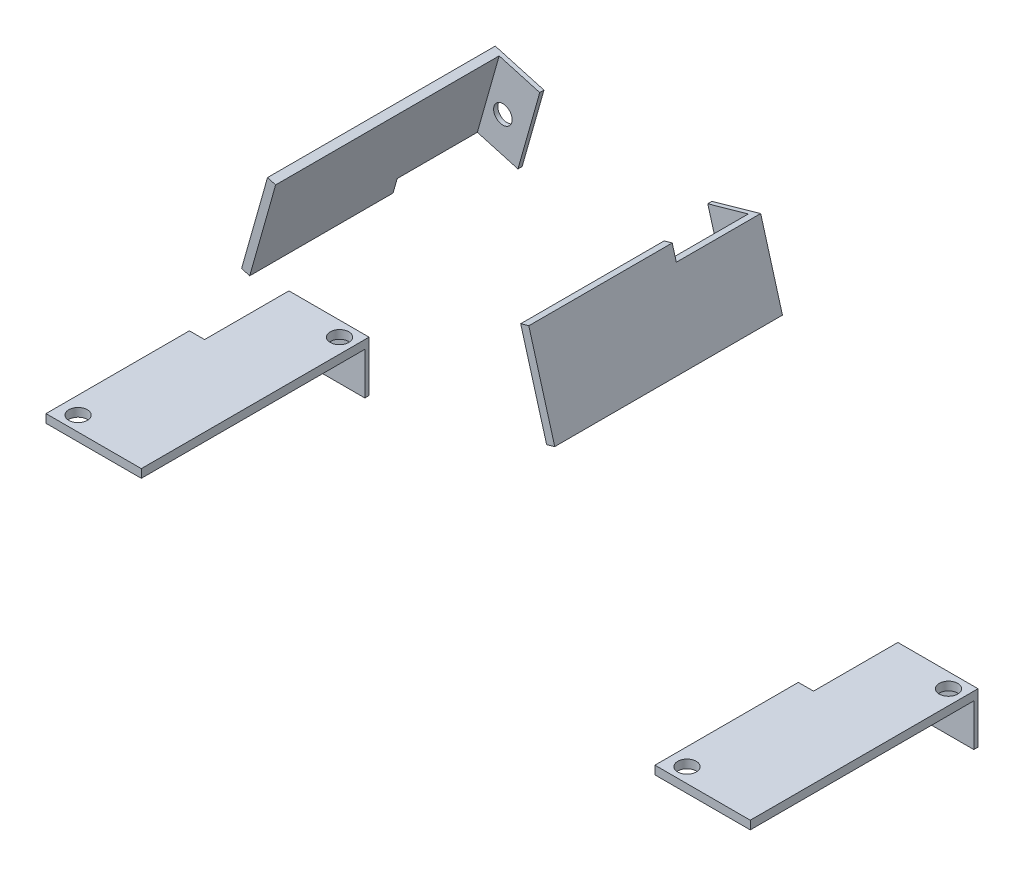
from build123d import *

# Parameters (mm, degrees)
SKETCH1_W             = 9.5
SKETCH1_H             = 6
SKETCH1_R             = 1.1
BOSS_EXTRUDE1_DEPTH   = 27
BOSS_EXTRUDE1_2_DEPTH = 27
BOSS_EXTRUDE1_3_DEPTH = 27
BOSS_EXTRUDE1_4_DEPTH = 27
SKETCH2_W             = 9.5
SKETCH2_H             = 5
CUT_EXTRUDE1_DEPTH    = 26.5
SKETCH3_W             = 17
SKETCH3_H             = 1
BOSS_EXTRUDE2_DEPTH   = 1.8
SKETCH4_W             = 17
SKETCH4_H             = 1
BOSS_EXTRUDE3_DEPTH   = 1.8
SKETCH5_W             = 1
SKETCH5_H             = 17
BOSS_EXTRUDE4_DEPTH   = 1.8
SKETCH6_W             = 1
SKETCH6_H             = 17
BOSS_EXTRUDE5_DEPTH   = 1.8
SKETCH7_R             = 1.1
CUT_EXTRUDE2_DEPTH    = 1


with BuildPart() as part:
    # Sketch1 → Boss-Extrude1 (new body)
    with BuildSketch(Plane.XY):
        with Locations((-35.25, 8)):
            Rectangle(SKETCH1_W, SKETCH1_H)
        with Locations((-36.412283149, 8)):
            Circle(SKETCH1_R, mode=Mode.SUBTRACT)
    extrude(amount=BOSS_EXTRUDE1_DEPTH)


with BuildPart() as body_2:
    # Sketch1 → Boss-Extrude1 2 (new body)
    with BuildSketch(Plane.XY):
        with Locations((36.942810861, 8)):
            Rectangle(SKETCH1_W, SKETCH1_H)
        with Locations((36.412283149, 8)):
            Circle(SKETCH1_R, mode=Mode.SUBTRACT)
    extrude(amount=BOSS_EXTRUDE1_2_DEPTH)


with BuildPart() as body_3:
    # Sketch1 → Boss-Extrude1 3 (new body)
    with BuildSketch(Plane.XY):
        Polygon((15.927890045, 46.904142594), (10.154262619, 45.271590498), (12.73913677, 36.13001374), (18.512764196, 37.762565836), align=None)
        with Locations((14.134917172, 42.301953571)):
            Circle(SKETCH1_R, mode=Mode.SUBTRACT)
    extrude(amount=BOSS_EXTRUDE1_3_DEPTH)


with BuildPart() as body_4:
    # Sketch1 → Boss-Extrude1 4 (new body)
    with BuildSketch(Plane.XY):
        Polygon((-18.123322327, 39.222379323), (-12.349694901, 37.589827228), (-9.76482075, 46.731403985), (-15.538448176, 48.363956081), align=None)
        with Locations((-14.134917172, 42.301953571)):
            Circle(SKETCH1_R, mode=Mode.SUBTRACT)
    extrude(amount=BOSS_EXTRUDE1_4_DEPTH)


with BuildPart() as cut_extrude1_tool:
    # Sketch2 → Cut-Extrude1 (new body)
    with BuildSketch(Plane.XY.offset(27)):
        with Locations((-35.25, 7.5)):
            Rectangle(SKETCH2_W, SKETCH2_H)
        Polygon((-12.349694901, 37.589827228), (-17.16105109, 38.950287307), (-14.576176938, 48.091864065), (-9.76482075, 46.731403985), align=None)
        Polygon((10.154262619, 45.271590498), (14.965618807, 46.632050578), (17.550492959, 37.49047382), (12.73913677, 36.13001374), align=None)
        with Locations((36.942810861, 7.5)):
            Rectangle(SKETCH2_W, SKETCH2_H)
    extrude(amount=-CUT_EXTRUDE1_DEPTH)


with BuildPart() as part_1:
    add(part.part)

    # Cut-Extrude1: cut by cut_extrude1_tool
    add(cut_extrude1_tool.part, mode=Mode.SUBTRACT)

    # Sketch3 → Boss-Extrude2 (add)
    with BuildSketch(Plane.ZY.offset(40)):
        with Locations((18.5, 10.5)):
            Rectangle(SKETCH3_W, SKETCH3_H)
    extrude(amount=BOSS_EXTRUDE2_DEPTH)


with BuildPart() as body_2_1:
    add(body_2.part)

    # Cut-Extrude1: cut by cut_extrude1_tool
    add(cut_extrude1_tool.part, mode=Mode.SUBTRACT)

    # Sketch4 → Boss-Extrude3 (add)
    with BuildSketch(Plane.ZY.offset(-32.192810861)):
        with Locations((18.5, 10.5)):
            Rectangle(SKETCH4_W, SKETCH4_H)
    extrude(amount=BOSS_EXTRUDE3_DEPTH)


with BuildPart() as body_3_1:
    add(body_3.part)

    # Cut-Extrude1: cut by cut_extrude1_tool
    add(cut_extrude1_tool.part, mode=Mode.SUBTRACT)

    # Sketch5 → Boss-Extrude4 (add)
    with BuildSketch(Plane(origin=(-11.101532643, 39.261297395, 0), x_dir=(0.9622712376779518, 0.272092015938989, 0), z_dir=(-0.27209201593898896, 0.9622712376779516, 0))):
        with Locations((27.589193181, -18.5)):
            Rectangle(SKETCH5_W, SKETCH5_H)
    extrude(amount=BOSS_EXTRUDE4_DEPTH)


with BuildPart() as body_4_1:
    add(body_4.part)

    # Cut-Extrude1: cut by cut_extrude1_tool
    add(cut_extrude1_tool.part, mode=Mode.SUBTRACT)

    # Sketch6 → Boss-Extrude5 (add)
    with BuildSketch(Plane(origin=(8.927708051, 31.573424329, 0), x_dir=(0.9622712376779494, -0.2720920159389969, 0), z_dir=(-0.2720920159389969, -0.9622712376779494, 0))):
        with Locations((-27.611648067, 18.5)):
            Rectangle(SKETCH6_W, SKETCH6_H)
    extrude(amount=BOSS_EXTRUDE5_DEPTH)


with BuildPart() as cut_extrude2_tool:
    # Sketch7 → Cut-Extrude2 (new body)
    with BuildSketch(Plane.XZ.offset(-10)):
        with Locations(Location((32.442810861, 25.25, 0), (0, 0, 270))):
            Circle(SKETCH7_R)
        with Locations(Location((39.942810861, 1.75, 0), (0, 0, 270))):
            Circle(SKETCH7_R)
        with Locations(Location((-39.75, 25.25, 0), (0, 0, 270))):
            Circle(SKETCH7_R)
        with Locations(Location((-32.25, 1.75, 0), (0, 0, 270))):
            Circle(SKETCH7_R)
    extrude(amount=-CUT_EXTRUDE2_DEPTH)


with BuildPart() as part_2:
    add(part_1.part)

    # Cut-Extrude2: cut by cut_extrude2_tool
    add(cut_extrude2_tool.part, mode=Mode.SUBTRACT)


with BuildPart() as body_2_2:
    add(body_2_1.part)

    # Cut-Extrude2: cut by cut_extrude2_tool
    add(cut_extrude2_tool.part, mode=Mode.SUBTRACT)


solid = Compound([body_3_1.part, body_4_1.part, part_2.part, body_2_2.part])
